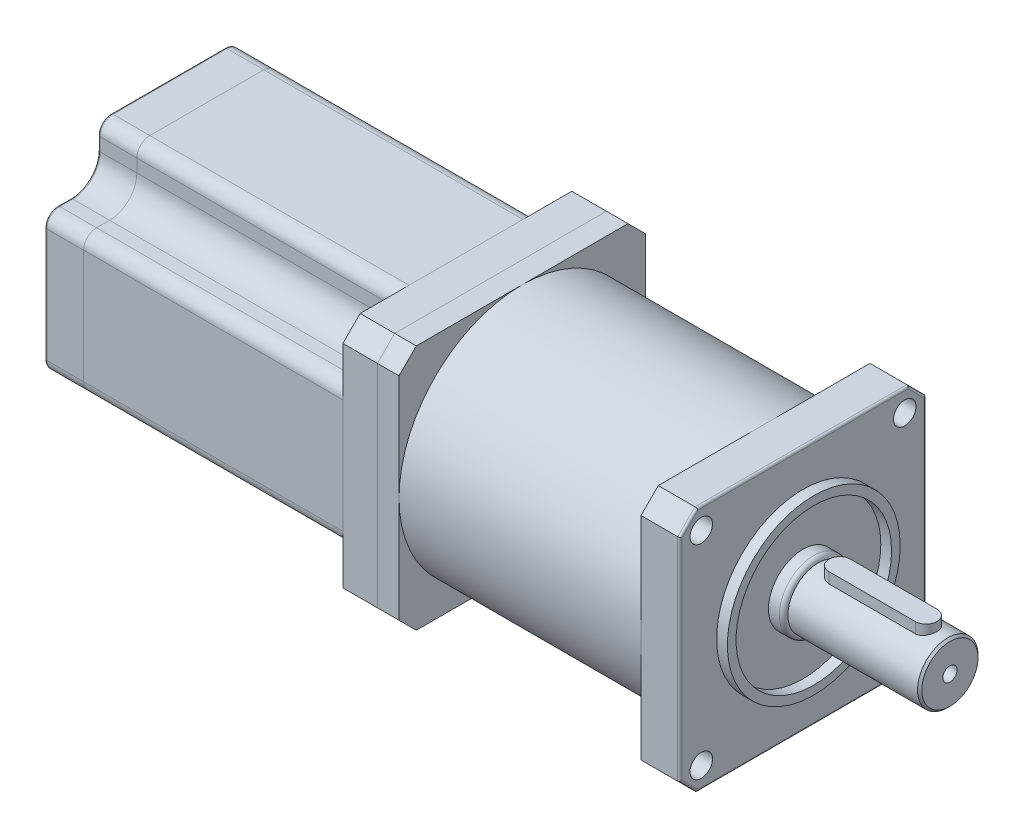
from build123d import *

# Parameters (mm, degrees)
EXTRUDE_1_DEPTH     = 9
SKETCH_2_R          = 28.5
EXTRUDE_2_DEPTH     = 56
EXTRUDE_3_DEPTH     = 5
EXTRUDE_4_DEPTH     = 8
EXTRUDE_5_DEPTH     = 60
EXTRUDE_6_DEPTH     = 9
CUT_EXTRUDE_1_DEPTH = 69
FILLET_1_R          = 0.5
FILLET_2_R          = 0.5
SKETCH_8_R          = 2.6
CUT_EXTRUDE_2_DEPTH = 9
SKETCH_9_R          = 20
SKETCH_9_R_2        = 18
EXTRUDE_7_DEPTH     = 2.5
SKETCH_10_R         = 8
EXTRUDE_8_DEPTH     = 3.5
FILLET_3_R          = 1
SKETCH_11_R         = 7
EXTRUDE_9_DEPTH     = 30.5
CUT_EXTRUDE_3_DEPTH = 3
EXTRUDE_10_DEPTH    = 5
CHAMFER_1_SIZE      = 0.5


with BuildPart() as part:
    # Sketch 1 → Extrude 1 (new body)
    with BuildSketch(Plane(origin=(0, 0, 0), x_dir=(0, 0, -1), z_dir=(1, 0, 0))):
        Polygon((-28.5, 24.5), (-24.5, 28.5), (24.5, 28.5), (28.5, 24.5), (28.5, -24.5), (24.5, -28.5), (-24.5, -28.5), (-28.5, -24.5), align=None)
    extrude(amount=-EXTRUDE_1_DEPTH)

    # Sketch 2 → Extrude 2 (add)
    with BuildSketch(Plane.ZY.offset(9)):
        Circle(SKETCH_2_R)
    extrude(amount=EXTRUDE_2_DEPTH)

    # Sketch 3 → Extrude 3 (add)
    with BuildSketch(Plane.ZY.offset(65)):
        Polygon((-24.5, -28.5), (24.5, -28.5), (28.5, -24.5), (28.5, 24.5), (24.5, 28.5), (-24.5, 28.5), (-28.5, 24.5), (-28.5, -24.5), align=None)
    extrude(amount=EXTRUDE_3_DEPTH)

    # Fillet 2
    fillet_2_edges = [part.edges().sort_by_distance(p)[0] for p in [
        (0, 26.5, 26.5),
        (0, 28.5, 0),
        (0, 26.5, -26.5),
        (0, 0, -28.5),
        (0, -26.5, -26.5),
        (0, -28.5, 0),
        (0, -26.5, 26.5),
        (0, 0, 28.5),
    ]]
    fillet(fillet_2_edges, radius=FILLET_2_R)

    # Sketch 8 → Cut-Extrude 2 (cut)
    with BuildSketch(Plane(origin=(0, 0, 0), x_dir=(0, 0, -1), z_dir=(1, 0, 0))):
        with Locations((-23.55, 23.55)):
            Circle(SKETCH_8_R)
        with Locations((23.55, 23.55)):
            Circle(SKETCH_8_R)
        with Locations((23.55, -23.55)):
            Circle(SKETCH_8_R)
        with Locations((-23.55, -23.55)):
            Circle(SKETCH_8_R)
    extrude(amount=-CUT_EXTRUDE_2_DEPTH, mode=Mode.SUBTRACT)

    # Sketch 9 → Extrude 7 (add)
    with BuildSketch(Plane(origin=(0, 0, 0), x_dir=(0, 0, -1), z_dir=(1, 0, 0))):
        Circle(SKETCH_9_R)
        Circle(SKETCH_9_R_2, mode=Mode.SUBTRACT)
    extrude(amount=EXTRUDE_7_DEPTH)

    # Sketch 10 → Extrude 8 (add)
    with BuildSketch(Plane(origin=(0, 0, 0), x_dir=(0, 0, -1), z_dir=(1, 0, 0))):
        Circle(SKETCH_10_R)
    extrude(amount=EXTRUDE_8_DEPTH)

    # Fillet 3
    fillet_3_edges = [part.edges().sort_by_distance(p)[0] for p in [
        (3.5, 0, 8),
    ]]
    fillet(fillet_3_edges, radius=FILLET_3_R)


with BuildPart() as body_2:
    # Sketch 4 → Extrude 4 (new body)
    with BuildSketch(Plane.ZY.offset(70)):
        Polygon((-24.5, -28.5), (24.5, -28.5), (28.5, -24.5), (28.5, 24.5), (24.5, 28.5), (-24.5, 28.5), (-28.5, 24.5), (-28.5, -24.5), align=None)
    extrude(amount=EXTRUDE_4_DEPTH)


with BuildPart() as body_3:
    # Sketch 5 → Extrude 5 (new body)
    with BuildSketch(Plane.ZY.offset(78)):
        Polygon((-24.5, -28.5), (24.5, -28.5), (28.5, -24.5), (28.5, 24.5), (24.5, 28.5), (-24.5, 28.5), (-28.5, 24.5), (-28.5, -24.5), align=None)
    extrude(amount=EXTRUDE_5_DEPTH)


with BuildPart() as body_4:
    # Sketch 6 → Extrude 6 (new body)
    with BuildSketch(Plane.ZY.offset(138)):
        Polygon((-24.5, -28.5), (24.5, -28.5), (28.5, -24.5), (28.5, 24.5), (24.5, 28.5), (-24.5, 28.5), (-28.5, 24.5), (-28.5, -24.5), align=None)
    extrude(amount=EXTRUDE_6_DEPTH)


with BuildPart() as cut_extrude_1_tool:
    # Sketch 7 → Cut-Extrude 1 (new body)
    with BuildSketch(Plane.ZY.offset(147)):
        with BuildLine():
            Line((-22.5, 16.17544468), (-25.5, 16.17544468))
            ThreePointArc((-25.5, 16.17544468), (-27.621320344, 15.296765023), (-28.5, 13.17544468))
            Line((-28.5, 13.17544468), (-28.5, 24.5))
            Line((-28.5, 24.5), (-24.5, 28.5))
            Line((-24.5, 28.5), (-13.17544468, 28.5))
            ThreePointArc((-13.17544468, 28.5), (-15.296765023, 27.621320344), (-16.17544468, 25.5))
            Line((-16.17544468, 25.5), (-16.17544468, 22.5))
            ThreePointArc((-16.17544468, 22.5), (-18.027864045, 18.027864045), (-22.5, 16.17544468))
        make_face()
        with BuildLine():
            Line((13.17544468, 28.5), (24.5, 28.5))
            Line((24.5, 28.5), (28.5, 24.5))
            Line((28.5, 24.5), (28.5, 13.17544468))
            ThreePointArc((28.5, 13.17544468), (27.621320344, 15.296765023), (25.5, 16.17544468))
            Line((25.5, 16.17544468), (22.5, 16.17544468))
            ThreePointArc((22.5, 16.17544468), (18.027864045, 18.027864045), (16.17544468, 22.5))
            Line((16.17544468, 22.5), (16.17544468, 25.5))
            ThreePointArc((16.17544468, 25.5), (15.296765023, 27.621320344), (13.17544468, 28.5))
        make_face()
        with BuildLine():
            Line((-25.5, -16.17544468), (-22.5, -16.17544468))
            ThreePointArc((-22.5, -16.17544468), (-18.027864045, -18.027864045), (-16.17544468, -22.5))
            Line((-16.17544468, -22.5), (-16.17544468, -25.5))
            ThreePointArc((-16.17544468, -25.5), (-15.296765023, -27.621320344), (-13.17544468, -28.5))
            Line((-13.17544468, -28.5), (-24.5, -28.5))
            Line((-24.5, -28.5), (-28.5, -24.5))
            Line((-28.5, -24.5), (-28.5, -13.17544468))
            ThreePointArc((-28.5, -13.17544468), (-27.621320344, -15.296765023), (-25.5, -16.17544468))
        make_face()
        with BuildLine():
            Line((28.5, -13.17544468), (28.5, -24.5))
            Line((28.5, -24.5), (24.5, -28.5))
            Line((24.5, -28.5), (13.17544468, -28.5))
            ThreePointArc((13.17544468, -28.5), (15.296765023, -27.621320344), (16.17544468, -25.5))
            Line((16.17544468, -25.5), (16.17544468, -22.5))
            ThreePointArc((16.17544468, -22.5), (18.027864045, -18.027864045), (22.5, -16.17544468))
            Line((22.5, -16.17544468), (25.5, -16.17544468))
            ThreePointArc((25.5, -16.17544468), (27.621320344, -15.296765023), (28.5, -13.17544468))
        make_face()
    extrude(amount=-CUT_EXTRUDE_1_DEPTH)


with BuildPart() as body_3_1:
    add(body_3.part)

    # Cut-Extrude 1: cut by cut_extrude_1_tool
    add(cut_extrude_1_tool.part, mode=Mode.SUBTRACT)


with BuildPart() as body_4_1:
    add(body_4.part)

    # Cut-Extrude 1: cut by cut_extrude_1_tool
    add(cut_extrude_1_tool.part, mode=Mode.SUBTRACT)

    # Fillet 1
    fillet_1_edges = [body_4_1.edges().sort_by_distance(p)[0] for p in [
        (-147, 18.027864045, 18.027864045),
        (-147, 16.17544468, 24),
        (-147, 15.296765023, 27.621320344),
        (-147, 27.621320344, 15.296765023),
        (-147, 24, 16.17544468),
        (-147, 0, -28.5),
        (-147, -28.5, 0),
        (-147, 0, 28.5),
        (-147, 28.5, 0),
        (-147, 27.621320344, -15.296765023),
        (-147, 15.296765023, -27.621320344),
        (-147, 16.17544468, -24),
        (-147, 18.027864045, -18.027864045),
        (-147, 24, -16.17544468),
        (-147, -18.027864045, -18.027864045),
        (-147, -16.17544468, -24),
        (-147, -15.296765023, -27.621320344),
        (-147, -27.621320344, -15.296765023),
        (-147, -24, -16.17544468),
        (-147, -18.027864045, 18.027864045),
        (-147, -24, 16.17544468),
        (-147, -27.621320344, 15.296765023),
        (-147, -15.296765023, 27.621320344),
        (-147, -16.17544468, 24),
    ]]
    fillet(fillet_1_edges, radius=FILLET_1_R)


with BuildPart() as body_5:
    # Sketch 11 → Extrude 9 (new body)
    with BuildSketch(Plane(origin=(3.5, 0, 0), x_dir=(0, 0, -1), z_dir=(1, 0, 0))):
        with Locations(Location((0, 0, 0), (0, 0, 180))):
            Circle(SKETCH_11_R)
    extrude(amount=EXTRUDE_9_DEPTH)

    # Sketch 12 → Cut-Extrude 3 (cut)
    with BuildSketch(Plane(origin=(0, 7, 0), x_dir=(1, 0, 0), z_dir=(0, 1, 0))):
        with BuildLine():
            Line((8.5, 2.5), (28.5, 2.5))
            ThreePointArc((28.5, 2.5), (31, 0), (28.5, -2.5))
            Line((28.5, -2.5), (8.5, -2.5))
            ThreePointArc((8.5, -2.5), (6, 0), (8.5, 2.5))
        make_face()
    extrude(amount=-CUT_EXTRUDE_3_DEPTH, mode=Mode.SUBTRACT)

    # Chamfer 1
    chamfer_1_edges = [body_5.edges().sort_by_distance(p)[0] for p in [
        (34, 0, -7),
    ]]
    chamfer(chamfer_1_edges, length=CHAMFER_1_SIZE)

    # Sketch 16 → Hole Wizard M4 _1 (revolve, cut)
    with BuildSketch(Plane(origin=(34, 0, 0), x_dir=(0, 0, -1), z_dir=(0, 1, 0))):
        Polygon((0, 0), (0, 10.491420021), (1.65, 9.5), (1.65, 0), align=None)
    revolve(axis=Axis((40.35, 0, 0), (-1, 0, 0)), mode=Mode.SUBTRACT)


with BuildPart() as body_6:
    # Sketch 13 → Extrude 10 (new body)
    with BuildSketch(Plane(origin=(0, 4, 0), x_dir=(1, 0, 0), z_dir=(0, 1, 0))):
        with BuildLine():
            Line((28.5, 2.5), (8.5, 2.5))
            ThreePointArc((8.5, 2.5), (6, 0), (8.5, -2.5))
            Line((8.5, -2.5), (28.5, -2.5))
            ThreePointArc((28.5, -2.5), (31, 0), (28.5, 2.5))
        make_face()
    extrude(amount=EXTRUDE_10_DEPTH)


solid = Compound([part.part, body_2.part, body_3_1.part, body_4_1.part, body_5.part, body_6.part])
